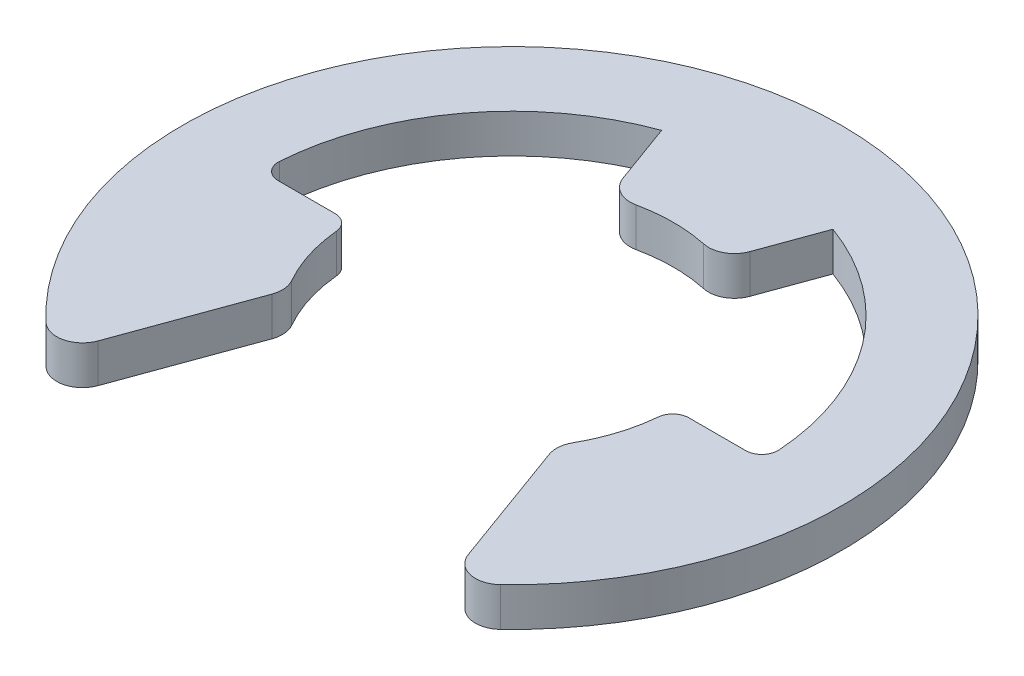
from build123d import *

# Parameters (mm, degrees)
BOSS_EXTRUDE1_DEPTH = 0.6
FILLET1_R           = 0.8
FILLET2_R           = 0.5


with BuildPart() as part:
    # Sketch2 → Boss-Extrude1 (new, symmetric)
    with BuildSketch(Plane(origin=(0, 0, 0), x_dir=(1, 0, 0), z_dir=(0, 1, 0))):
        with BuildLine():
            Line((-6.120304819, -8.159771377), (-4.16, -2.773878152))
            ThreePointArc((-4.16, -2.773878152), (-4.785394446, -1.449137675), (-5, 0))
            Line((-5, 0), (-7.75, 0))
            ThreePointArc((-7.75, 0), (-6.348428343, 4.445217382), (-2.650656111, 7.282617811))
            Line((-2.650656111, 7.282617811), (-1.710100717, 4.698463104))
            ThreePointArc((-1.710100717, 4.698463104), (0, 5), (1.710100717, 4.698463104))
            Line((1.710100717, 4.698463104), (2.650656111, 7.282617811))
            ThreePointArc((2.650656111, 7.282617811), (6.348428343, 4.445217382), (7.75, 0))
            Line((7.75, 0), (5, 0))
            ThreePointArc((5, 0), (4.785394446, -1.449137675), (4.16, -2.773878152))
            Line((4.16, -2.773878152), (6.120304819, -8.159771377))
            ThreePointArc((6.120304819, -8.159771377), (0, 10.2), (-6.120304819, -8.159771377))
        make_face()
    extrude(amount=BOSS_EXTRUDE1_DEPTH, both=True)

    # Fillet1
    fillet1_edges = [part.edges().sort_by_distance(p)[0] for p in [
        (-4.16, 0, 2.773878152),
        (-6.120304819, 0, 8.159771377),
        (6.120304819, 0, 8.159771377),
        (4.16, 0, 2.773878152),
        (1.710100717, 0, -4.698463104),
        (-1.710100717, 0, -4.698463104),
    ]]
    fillet(fillet1_edges, radius=FILLET1_R)

    # Fillet2
    fillet2_edges = [part.edges().sort_by_distance(p)[0] for p in [
        (-7.75, 0, 0),
        (-5, 0, 0),
        (5, 0, 0),
        (7.75, 0, 0),
    ]]
    fillet(fillet2_edges, radius=FILLET2_R)


solid = part.part
